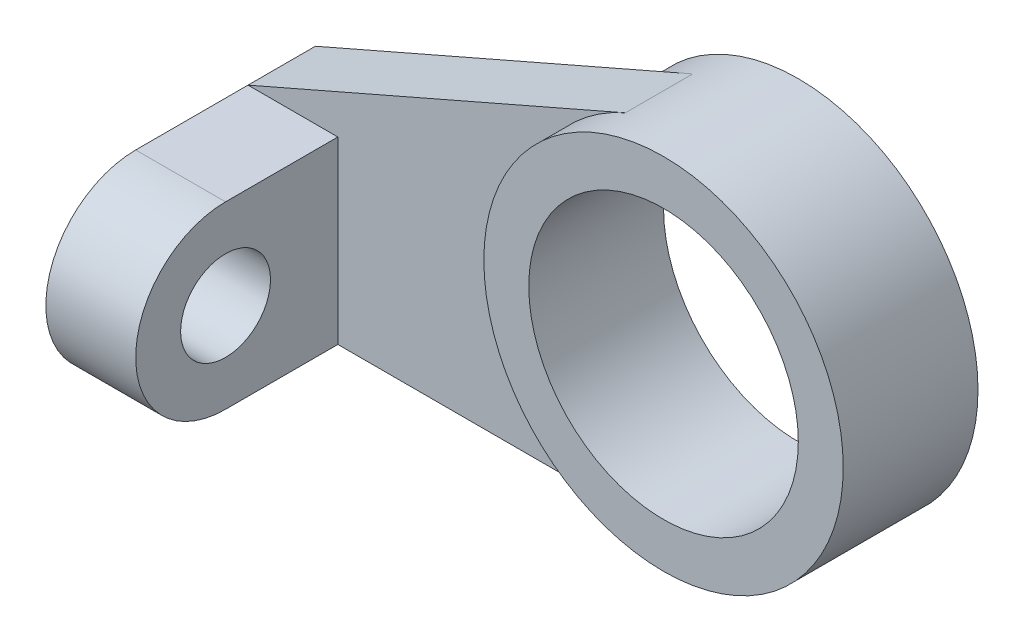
from build123d import *

# Parameters (mm, degrees)
SKETCH1_R           = 50.8
SKETCH1_R_2         = 38.1
EXTRUDE_THIN1_DEPTH = 19.05
BOSS_EXTRUDE1_DEPTH = 9.525
SKETCH4_R           = 12.7
BOSS_EXTRUDE2_DEPTH = 25.4


with BuildPart() as part:
    # Sketch1 → Extrude-Thin1 (new, symmetric)
    with BuildSketch(Plane.XY):
        Circle(SKETCH1_R)
        Circle(SKETCH1_R_2, mode=Mode.SUBTRACT)
    extrude(amount=EXTRUDE_THIN1_DEPTH, both=True)

    # Sketch3 → Boss-Extrude1 (add, symmetric)
    with BuildSketch(Plane.XY):
        with BuildLine():
            Line((0, -50.8), (-127, -50.8))
            Line((-127, -50.8), (-127, 0))
            Line((-127, 0), (-20.32, 46.558969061))
            ThreePointArc((-20.32, 46.558969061), (-49.728440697, -10.378929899), (0, -50.8))
        make_face()
    extrude(amount=BOSS_EXTRUDE1_DEPTH, both=True)

    # Sketch4 → Boss-Extrude2 (add)
    with BuildSketch(Plane.ZY.offset(127)):
        with BuildLine():
            Line((9.525, 0), (41.275, 0))
            ThreePointArc((41.275, 0), (66.675, -25.4), (41.275, -50.8))
            Line((41.275, -50.8), (9.525, -50.8))
            Line((9.525, -50.8), (9.525, 0))
        make_face()
        with Locations((41.275, -25.4)):
            Circle(SKETCH4_R, mode=Mode.SUBTRACT)
    extrude(amount=-BOSS_EXTRUDE2_DEPTH)


solid = part.part
